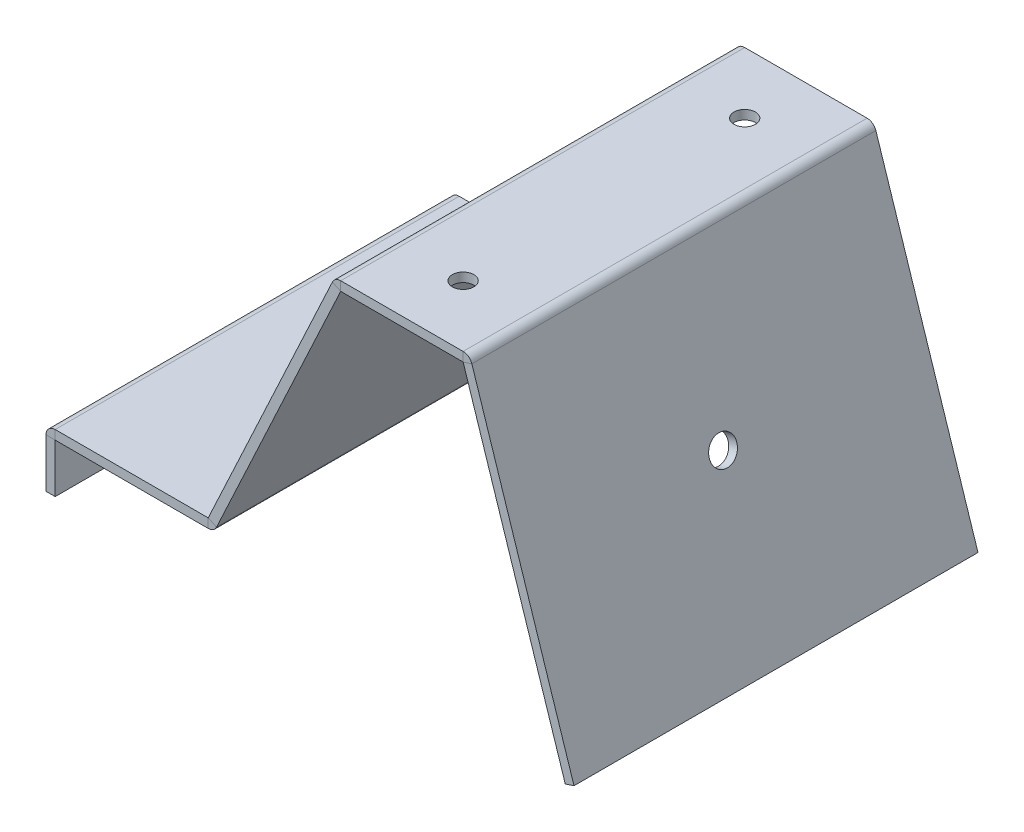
ISO-10303-21;
HEADER;
FILE_DESCRIPTION(('STEP AP214'),'2;1');
FILE_NAME('part.step','',(''),(''),'','','');
FILE_SCHEMA(('AUTOMOTIVE_DESIGN { 1 0 10303 214 1 1 1 1 }'));
ENDSEC;
DATA;
#1=APPLICATION_CONTEXT('core data for automotive mechanical design processes');
#2=APPLICATION_PROTOCOL_DEFINITION('international standard','automotive_design',2000,#1);
#3=PRODUCT_CONTEXT('',#1,'mechanical');
#4=PRODUCT('Part','Part','',(#3));
#5=PRODUCT_RELATED_PRODUCT_CATEGORY('part','',(#4));
#6=PRODUCT_DEFINITION_FORMATION('','',#4);
#7=PRODUCT_DEFINITION_CONTEXT('part definition',#1,'design');
#8=PRODUCT_DEFINITION('design','',#6,#7);
#9=PRODUCT_DEFINITION_SHAPE('','',#8);
#10=(LENGTH_UNIT() NAMED_UNIT(*) SI_UNIT(.MILLI.,.METRE.));
#11=(NAMED_UNIT(*) PLANE_ANGLE_UNIT() SI_UNIT($,.RADIAN.));
#12=(NAMED_UNIT(*) SI_UNIT($,.STERADIAN.) SOLID_ANGLE_UNIT());
#13=UNCERTAINTY_MEASURE_WITH_UNIT(LENGTH_MEASURE(1.E-05),#10,'distance_accuracy_value','');
#14=(GEOMETRIC_REPRESENTATION_CONTEXT(3) GLOBAL_UNCERTAINTY_ASSIGNED_CONTEXT((#13)) GLOBAL_UNIT_ASSIGNED_CONTEXT((#10,
#11,#12)) REPRESENTATION_CONTEXT('',''));
#15=CARTESIAN_POINT('',(0.,0.,0.));
#16=DIRECTION('',(0.,0.,1.));
#17=DIRECTION('',(1.,0.,0.));
#18=AXIS2_PLACEMENT_3D('',#15,#16,#17);
#19=CARTESIAN_POINT('',(-26.3546872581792,44.3689575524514,-66.));
#20=DIRECTION('',(0.,-1.,0.));
#21=DIRECTION('',(0.,0.,-1.));
#22=AXIS2_PLACEMENT_3D('',#19,#20,#21);
#23=PLANE('',#22);
#24=CARTESIAN_POINT('',(64.6453127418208,44.3689575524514,-10.));
#25=DIRECTION('',(0.,1.,0.));
#26=DIRECTION('',(0.,0.,1.));
#27=AXIS2_PLACEMENT_3D('',#24,#25,#26);
#28=CIRCLE('',#27,1.75);
#29=CARTESIAN_POINT('',(64.6453127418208,44.3689575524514,-8.25));
#30=VERTEX_POINT('',#29);
#31=EDGE_CURVE('E239',#30,#30,#28,.T.);
#32=ORIENTED_EDGE('',*,*,#31,.T.);
#33=EDGE_LOOP('',(#32));
#34=FACE_BOUND('',#33,.T.);
#35=CARTESIAN_POINT('',(64.6453127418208,44.3689575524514,-56.));
#36=DIRECTION('',(0.,1.,0.));
#37=DIRECTION('',(0.,0.,1.));
#38=AXIS2_PLACEMENT_3D('',#35,#36,#37);
#39=CIRCLE('',#38,1.75);
#40=CARTESIAN_POINT('',(64.6453127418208,44.3689575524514,-54.25));
#41=VERTEX_POINT('',#40);
#42=EDGE_CURVE('E236',#41,#41,#39,.T.);
#43=ORIENTED_EDGE('',*,*,#42,.T.);
#44=EDGE_LOOP('',(#43));
#45=FACE_BOUND('',#44,.T.);
#46=DIRECTION('',(-1.,0.,0.));
#47=VECTOR('',#46,1.);
#48=CARTESIAN_POINT('',(-26.3546872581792,44.3689575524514,-66.));
#49=LINE('',#48,#47);
#50=CARTESIAN_POINT('',(74.6446749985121,44.3689575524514,-66.));
#51=VERTEX_POINT('',#50);
#52=CARTESIAN_POINT('',(54.6458884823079,44.3689575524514,-66.));
#53=VERTEX_POINT('',#52);
#54=EDGE_CURVE('E65',#51,#53,#49,.T.);
#55=ORIENTED_EDGE('',*,*,#54,.F.);
#56=DIRECTION('',(0.,0.,1.));
#57=VECTOR('',#56,1.);
#58=CARTESIAN_POINT('',(74.6446749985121,44.3689575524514,-66.));
#59=LINE('',#58,#57);
#60=CARTESIAN_POINT('',(74.6446749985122,44.3689575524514,0.));
#61=VERTEX_POINT('',#60);
#62=EDGE_CURVE('E57',#51,#61,#59,.T.);
#63=ORIENTED_EDGE('',*,*,#62,.T.);
#64=DIRECTION('',(1.,0.,0.));
#65=VECTOR('',#64,1.);
#66=CARTESIAN_POINT('',(-26.3546872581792,44.3689575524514,0.));
#67=LINE('',#66,#65);
#68=CARTESIAN_POINT('',(54.6458884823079,44.3689575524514,0.));
#69=VERTEX_POINT('',#68);
#70=EDGE_CURVE('E73',#69,#61,#67,.T.);
#71=ORIENTED_EDGE('',*,*,#70,.F.);
#72=DIRECTION('',(0.,0.,1.));
#73=VECTOR('',#72,1.);
#74=CARTESIAN_POINT('',(54.6458884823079,44.3689575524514,-66.));
#75=LINE('',#74,#73);
#76=EDGE_CURVE('E226',#53,#69,#75,.T.);
#77=ORIENTED_EDGE('',*,*,#76,.F.);
#78=EDGE_LOOP('',(#55,#63,#71,#77));
#79=FACE_BOUND('',#78,.T.);
#80=ADVANCED_FACE('F48',(#34,#45,#79),#23,.T.);
#81=CARTESIAN_POINT('',(20.4131462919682,-29.042028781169,-66.));
#82=DIRECTION('',(0.906307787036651,-0.422618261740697,0.));
#83=DIRECTION('',(0.,0.,-1.));
#84=AXIS2_PLACEMENT_3D('',#81,#82,#83);
#85=PLANE('',#84);
#86=DIRECTION('',(-0.422618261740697,-0.906307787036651,0.));
#87=VECTOR('',#86,1.);
#88=CARTESIAN_POINT('',(20.4131462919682,-29.042028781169,-66.));
#89=LINE('',#88,#87);
#90=CARTESIAN_POINT('',(54.6449821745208,44.3683801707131,-66.));
#91=VERTEX_POINT('',#90);
#92=CARTESIAN_POINT('',(34.359792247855,0.866649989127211,-66.));
#93=VERTEX_POINT('',#92);
#94=EDGE_CURVE('E271',#91,#93,#89,.T.);
#95=ORIENTED_EDGE('',*,*,#94,.F.);
#96=DIRECTION('',(0.,0.,1.));
#97=VECTOR('',#96,1.);
#98=CARTESIAN_POINT('',(54.6449821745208,44.3683801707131,-66.));
#99=LINE('',#98,#97);
#100=CARTESIAN_POINT('',(54.6449821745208,44.3683801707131,0.));
#101=VERTEX_POINT('',#100);
#102=EDGE_CURVE('E377',#91,#101,#99,.T.);
#103=ORIENTED_EDGE('',*,*,#102,.T.);
#104=DIRECTION('',(0.422618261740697,0.906307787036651,0.));
#105=VECTOR('',#104,1.);
#106=CARTESIAN_POINT('',(20.4131462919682,-29.042028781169,0.));
#107=LINE('',#106,#105);
#108=CARTESIAN_POINT('',(34.359792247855,0.866649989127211,0.));
#109=VERTEX_POINT('',#108);
#110=EDGE_CURVE('E272',#109,#101,#107,.T.);
#111=ORIENTED_EDGE('',*,*,#110,.F.);
#112=DIRECTION('',(0.,0.,-1.));
#113=VECTOR('',#112,1.);
#114=CARTESIAN_POINT('',(34.359792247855,0.866649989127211,-66.));
#115=LINE('',#114,#113);
#116=EDGE_CURVE('E268',#109,#93,#115,.T.);
#117=ORIENTED_EDGE('',*,*,#116,.T.);
#118=EDGE_LOOP('',(#95,#103,#111,#117));
#119=FACE_BOUND('',#118,.T.);
#120=ADVANCED_FACE('F471',(#119),#85,.T.);
#121=CARTESIAN_POINT('',(0.,1.5,-66.));
#122=DIRECTION('',(0.,0.,1.));
#123=DIRECTION('',(1.,0.,0.));
#124=AXIS2_PLACEMENT_3D('',#121,#122,#123);
#125=PLANE('',#124);
#126=DIRECTION('',(-1.,0.,0.));
#127=VECTOR('',#126,1.);
#128=CARTESIAN_POINT('',(0.,1.5,-66.));
#129=LINE('',#128,#127);
#130=CARTESIAN_POINT('',(32.999424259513,1.5,-66.));
#131=VERTEX_POINT('',#130);
#132=CARTESIAN_POINT('',(8.00079717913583,1.5,-66.));
#133=VERTEX_POINT('',#132);
#134=EDGE_CURVE('E320',#131,#133,#129,.T.);
#135=ORIENTED_EDGE('',*,*,#134,.F.);
#136=DIRECTION('',(0.,-1.,0.));
#137=VECTOR('',#136,1.);
#138=CARTESIAN_POINT('',(32.999424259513,1.5,-66.));
#139=LINE('',#138,#137);
#140=CARTESIAN_POINT('',(32.999424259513,0.,-66.));
#141=VERTEX_POINT('',#140);
#142=EDGE_CURVE('E362',#131,#141,#139,.T.);
#143=ORIENTED_EDGE('',*,*,#142,.T.);
#144=DIRECTION('',(-1.,0.,0.));
#145=VECTOR('',#144,1.);
#146=CARTESIAN_POINT('',(0.,0.,-66.));
#147=LINE('',#146,#145);
#148=CARTESIAN_POINT('',(8.00079717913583,0.,-66.));
#149=VERTEX_POINT('',#148);
#150=EDGE_CURVE('E311',#141,#149,#147,.T.);
#151=ORIENTED_EDGE('',*,*,#150,.T.);
#152=DIRECTION('',(0.,1.,0.));
#153=VECTOR('',#152,1.);
#154=CARTESIAN_POINT('',(8.00079717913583,1.5,-66.));
#155=LINE('',#154,#153);
#156=EDGE_CURVE('E307',#149,#133,#155,.T.);
#157=ORIENTED_EDGE('',*,*,#156,.T.);
#158=EDGE_LOOP('',(#135,#143,#151,#157));
#159=FACE_BOUND('',#158,.T.);
#160=ADVANCED_FACE('F484',(#159),#125,.F.);
#161=CARTESIAN_POINT('',(0.,1.5,0.));
#162=DIRECTION('',(0.,0.,-1.));
#163=DIRECTION('',(-1.,0.,0.));
#164=AXIS2_PLACEMENT_3D('',#161,#162,#163);
#165=PLANE('',#164);
#166=DIRECTION('',(1.,0.,0.));
#167=VECTOR('',#166,1.);
#168=CARTESIAN_POINT('',(0.,0.,0.));
#169=LINE('',#168,#167);
#170=CARTESIAN_POINT('',(8.00079717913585,0.,0.));
#171=VERTEX_POINT('',#170);
#172=CARTESIAN_POINT('',(32.999424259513,0.,0.));
#173=VERTEX_POINT('',#172);
#174=EDGE_CURVE('E315',#171,#173,#169,.T.);
#175=ORIENTED_EDGE('',*,*,#174,.T.);
#176=DIRECTION('',(0.,1.,0.));
#177=VECTOR('',#176,1.);
#178=CARTESIAN_POINT('',(32.999424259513,1.5,0.));
#179=LINE('',#178,#177);
#180=CARTESIAN_POINT('',(32.999424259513,1.5,0.));
#181=VERTEX_POINT('',#180);
#182=EDGE_CURVE('E357',#173,#181,#179,.T.);
#183=ORIENTED_EDGE('',*,*,#182,.T.);
#184=DIRECTION('',(1.,0.,0.));
#185=VECTOR('',#184,1.);
#186=CARTESIAN_POINT('',(0.,1.5,0.));
#187=LINE('',#186,#185);
#188=CARTESIAN_POINT('',(8.00079717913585,1.5,0.));
#189=VERTEX_POINT('',#188);
#190=EDGE_CURVE('E316',#189,#181,#187,.T.);
#191=ORIENTED_EDGE('',*,*,#190,.F.);
#192=DIRECTION('',(0.,-1.,0.));
#193=VECTOR('',#192,1.);
#194=CARTESIAN_POINT('',(8.00079717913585,1.5,0.));
#195=LINE('',#194,#193);
#196=EDGE_CURVE('E312',#189,#171,#195,.T.);
#197=ORIENTED_EDGE('',*,*,#196,.T.);
#198=EDGE_LOOP('',(#175,#183,#191,#197));
#199=FACE_BOUND('',#198,.T.);
#200=ADVANCED_FACE('F503',(#199),#165,.F.);
#201=CARTESIAN_POINT('',(0.,1.5,-66.));
#202=DIRECTION('',(0.,-1.,0.));
#203=DIRECTION('',(0.,0.,-1.));
#204=AXIS2_PLACEMENT_3D('',#201,#202,#203);
#205=PLANE('',#204);
#206=ORIENTED_EDGE('',*,*,#190,.T.);
#207=DIRECTION('',(0.,0.,-1.));
#208=VECTOR('',#207,1.);
#209=CARTESIAN_POINT('',(32.999424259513,1.5,-66.));
#210=LINE('',#209,#208);
#211=EDGE_CURVE('E349',#181,#131,#210,.T.);
#212=ORIENTED_EDGE('',*,*,#211,.T.);
#213=ORIENTED_EDGE('',*,*,#134,.T.);
#214=DIRECTION('',(0.,0.,1.));
#215=VECTOR('',#214,1.);
#216=CARTESIAN_POINT('',(8.00079717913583,1.5,-66.));
#217=LINE('',#216,#215);
#218=EDGE_CURVE('E317',#133,#189,#217,.T.);
#219=ORIENTED_EDGE('',*,*,#218,.T.);
#220=EDGE_LOOP('',(#206,#212,#213,#219));
#221=FACE_BOUND('',#220,.T.);
#222=ADVANCED_FACE('F488',(#221),#205,.F.);
#223=CARTESIAN_POINT('',(7.99979717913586,-8.00020282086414,-66.));
#224=DIRECTION('',(1.,0.,0.));
#225=DIRECTION('',(0.,0.,-1.));
#226=AXIS2_PLACEMENT_3D('',#223,#224,#225);
#227=PLANE('',#226);
#228=DIRECTION('',(0.,-1.,0.));
#229=VECTOR('',#228,1.);
#230=CARTESIAN_POINT('',(7.99979717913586,-8.00020282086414,-66.));
#231=LINE('',#230,#229);
#232=CARTESIAN_POINT('',(7.99979717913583,-0.000999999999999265,-66.));
#233=VERTEX_POINT('',#232);
#234=CARTESIAN_POINT('',(7.99979717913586,-8.00020282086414,-66.));
#235=VERTEX_POINT('',#234);
#236=EDGE_CURVE('E326',#233,#235,#231,.T.);
#237=ORIENTED_EDGE('',*,*,#236,.F.);
#238=DIRECTION('',(0.,0.,1.));
#239=VECTOR('',#238,1.);
#240=CARTESIAN_POINT('',(7.99979717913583,-0.000999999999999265,-66.));
#241=LINE('',#240,#239);
#242=CARTESIAN_POINT('',(7.99979717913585,-0.000999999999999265,0.));
#243=VERTEX_POINT('',#242);
#244=EDGE_CURVE('E343',#233,#243,#241,.T.);
#245=ORIENTED_EDGE('',*,*,#244,.T.);
#246=DIRECTION('',(0.,1.,0.));
#247=VECTOR('',#246,1.);
#248=CARTESIAN_POINT('',(7.99979717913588,-8.00020282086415,0.));
#249=LINE('',#248,#247);
#250=CARTESIAN_POINT('',(7.99979717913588,-8.00020282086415,0.));
#251=VERTEX_POINT('',#250);
#252=EDGE_CURVE('E329',#251,#243,#249,.T.);
#253=ORIENTED_EDGE('',*,*,#252,.F.);
#254=DIRECTION('',(0.,0.,1.));
#255=VECTOR('',#254,1.);
#256=CARTESIAN_POINT('',(7.99979717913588,-8.00020282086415,0.));
#257=LINE('',#256,#255);
#258=EDGE_CURVE('E310',#235,#251,#257,.T.);
#259=ORIENTED_EDGE('',*,*,#258,.F.);
#260=EDGE_LOOP('',(#237,#245,#253,#259));
#261=FACE_BOUND('',#260,.T.);
#262=ADVANCED_FACE('F517',(#261),#227,.T.);
#263=CARTESIAN_POINT('',(6.49979717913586,-8.00020282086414,-66.));
#264=DIRECTION('',(1.,0.,0.));
#265=DIRECTION('',(0.,0.,-1.));
#266=AXIS2_PLACEMENT_3D('',#263,#264,#265);
#267=PLANE('',#266);
#268=DIRECTION('',(0.,0.,1.));
#269=VECTOR('',#268,1.);
#270=CARTESIAN_POINT('',(6.49979717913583,-0.00100000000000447,-66.));
#271=LINE('',#270,#269);
#272=CARTESIAN_POINT('',(6.49979717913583,-0.00100000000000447,-66.));
#273=VERTEX_POINT('',#272);
#274=CARTESIAN_POINT('',(6.49979717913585,-0.00100000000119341,0.));
#275=VERTEX_POINT('',#274);
#276=EDGE_CURVE('E337',#273,#275,#271,.T.);
#277=ORIENTED_EDGE('',*,*,#276,.F.);
#278=DIRECTION('',(0.,-1.,0.));
#279=VECTOR('',#278,1.);
#280=CARTESIAN_POINT('',(6.49979717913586,-8.00020282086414,-66.));
#281=LINE('',#280,#279);
#282=CARTESIAN_POINT('',(6.49979717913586,-8.00020282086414,-66.));
#283=VERTEX_POINT('',#282);
#284=EDGE_CURVE('E334',#273,#283,#281,.T.);
#285=ORIENTED_EDGE('',*,*,#284,.T.);
#286=DIRECTION('',(0.,0.,1.));
#287=VECTOR('',#286,1.);
#288=CARTESIAN_POINT('',(6.49979717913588,-8.00020282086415,0.));
#289=LINE('',#288,#287);
#290=CARTESIAN_POINT('',(6.49979717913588,-8.00020282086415,0.));
#291=VERTEX_POINT('',#290);
#292=EDGE_CURVE('E322',#283,#291,#289,.T.);
#293=ORIENTED_EDGE('',*,*,#292,.T.);
#294=DIRECTION('',(0.,1.,0.));
#295=VECTOR('',#294,1.);
#296=CARTESIAN_POINT('',(6.49979717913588,-8.00020282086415,0.));
#297=LINE('',#296,#295);
#298=EDGE_CURVE('E325',#291,#275,#297,.T.);
#299=ORIENTED_EDGE('',*,*,#298,.T.);
#300=EDGE_LOOP('',(#277,#285,#293,#299));
#301=FACE_BOUND('',#300,.T.);
#302=ADVANCED_FACE('F525',(#301),#267,.F.);
#303=CARTESIAN_POINT('',(6.49979717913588,-8.00020282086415,0.));
#304=DIRECTION('',(0.,1.,0.));
#305=DIRECTION('',(0.,0.,-1.));
#306=AXIS2_PLACEMENT_3D('',#303,#304,#305);
#307=PLANE('',#306);
#308=ORIENTED_EDGE('',*,*,#258,.T.);
#309=DIRECTION('',(1.,0.,0.));
#310=VECTOR('',#309,1.);
#311=CARTESIAN_POINT('',(6.49979717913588,-8.00020282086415,0.));
#312=LINE('',#311,#310);
#313=EDGE_CURVE('E333',#291,#251,#312,.T.);
#314=ORIENTED_EDGE('',*,*,#313,.F.);
#315=ORIENTED_EDGE('',*,*,#292,.F.);
#316=DIRECTION('',(1.,0.,0.));
#317=VECTOR('',#316,1.);
#318=CARTESIAN_POINT('',(6.49979717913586,-8.00020282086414,-66.));
#319=LINE('',#318,#317);
#320=EDGE_CURVE('E330',#283,#235,#319,.T.);
#321=ORIENTED_EDGE('',*,*,#320,.T.);
#322=EDGE_LOOP('',(#308,#314,#315,#321));
#323=FACE_BOUND('',#322,.T.);
#324=ADVANCED_FACE('F530',(#323),#307,.F.);
#325=CARTESIAN_POINT('',(6.49979717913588,-8.00020282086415,0.));
#326=DIRECTION('',(0.,0.,-1.));
#327=DIRECTION('',(0.,-1.,0.));
#328=AXIS2_PLACEMENT_3D('',#325,#326,#327);
#329=PLANE('',#328);
#330=DIRECTION('',(1.,0.,0.));
#331=VECTOR('',#330,1.);
#332=CARTESIAN_POINT('',(6.49979717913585,-0.00100000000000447,0.));
#333=LINE('',#332,#331);
#334=EDGE_CURVE('E340',#275,#243,#333,.T.);
#335=ORIENTED_EDGE('',*,*,#334,.F.);
#336=ORIENTED_EDGE('',*,*,#298,.F.);
#337=ORIENTED_EDGE('',*,*,#313,.T.);
#338=ORIENTED_EDGE('',*,*,#252,.T.);
#339=EDGE_LOOP('',(#335,#336,#337,#338));
#340=FACE_BOUND('',#339,.T.);
#341=ADVANCED_FACE('F528',(#340),#329,.F.);
#342=CARTESIAN_POINT('',(6.49979717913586,-8.00020282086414,-66.));
#343=DIRECTION('',(0.,0.,1.));
#344=DIRECTION('',(0.,1.,0.));
#345=AXIS2_PLACEMENT_3D('',#342,#343,#344);
#346=PLANE('',#345);
#347=DIRECTION('',(-1.,0.,0.));
#348=VECTOR('',#347,1.);
#349=CARTESIAN_POINT('',(6.49979717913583,-0.00100000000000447,-66.));
#350=LINE('',#349,#348);
#351=EDGE_CURVE('E346',#233,#273,#350,.T.);
#352=ORIENTED_EDGE('',*,*,#351,.F.);
#353=ORIENTED_EDGE('',*,*,#236,.T.);
#354=ORIENTED_EDGE('',*,*,#320,.F.);
#355=ORIENTED_EDGE('',*,*,#284,.F.);
#356=EDGE_LOOP('',(#352,#353,#354,#355));
#357=FACE_BOUND('',#356,.T.);
#358=ADVANCED_FACE('F522',(#357),#346,.F.);
#359=CARTESIAN_POINT('',(0.,0.,-66.));
#360=DIRECTION('',(0.,-1.,0.));
#361=DIRECTION('',(0.,0.,-1.));
#362=AXIS2_PLACEMENT_3D('',#359,#360,#361);
#363=PLANE('',#362);
#364=DIRECTION('',(0.,0.,-1.));
#365=VECTOR('',#364,1.);
#366=CARTESIAN_POINT('',(32.999424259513,0.,-66.));
#367=LINE('',#366,#365);
#368=EDGE_CURVE('E360',#173,#141,#367,.T.);
#369=ORIENTED_EDGE('',*,*,#368,.F.);
#370=ORIENTED_EDGE('',*,*,#174,.F.);
#371=DIRECTION('',(0.,0.,1.));
#372=VECTOR('',#371,1.);
#373=CARTESIAN_POINT('',(8.00079717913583,0.,-66.));
#374=LINE('',#373,#372);
#375=EDGE_CURVE('E302',#149,#171,#374,.T.);
#376=ORIENTED_EDGE('',*,*,#375,.F.);
#377=ORIENTED_EDGE('',*,*,#150,.F.);
#378=EDGE_LOOP('',(#369,#370,#376,#377));
#379=FACE_BOUND('',#378,.T.);
#380=ADVANCED_FACE('F511',(#379),#363,.T.);
#381=CARTESIAN_POINT('',(8.00079717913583,-0.000999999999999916,-66.));
#382=DIRECTION('',(0.,0.,-1.));
#383=DIRECTION('',(-1.,0.,0.));
#384=AXIS2_PLACEMENT_3D('',#381,#382,#383);
#385=PLANE('',#384);
#386=ORIENTED_EDGE('',*,*,#156,.F.);
#387=CARTESIAN_POINT('',(8.00079717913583,-0.000999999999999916,-66.));
#388=DIRECTION('',(0.,0.,1.));
#389=DIRECTION('',(1.,0.,0.));
#390=AXIS2_PLACEMENT_3D('',#387,#388,#389);
#391=CIRCLE('',#390,0.000999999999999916);
#392=EDGE_CURVE('E289',#149,#233,#391,.T.);
#393=ORIENTED_EDGE('',*,*,#392,.T.);
#394=ORIENTED_EDGE('',*,*,#351,.T.);
#395=CARTESIAN_POINT('',(8.00079717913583,-0.000999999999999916,-66.));
#396=DIRECTION('',(0.,0.,1.));
#397=DIRECTION('',(1.,0.,0.));
#398=AXIS2_PLACEMENT_3D('',#395,#396,#397);
#399=CIRCLE('',#398,1.501);
#400=EDGE_CURVE('E295',#133,#273,#399,.T.);
#401=ORIENTED_EDGE('',*,*,#400,.F.);
#402=EDGE_LOOP('',(#386,#393,#394,#401));
#403=FACE_BOUND('',#402,.T.);
#404=ADVANCED_FACE('F492',(#403),#385,.T.);
#405=CARTESIAN_POINT('',(8.00079717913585,-0.000999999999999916,0.));
#406=DIRECTION('',(0.,0.,1.));
#407=DIRECTION('',(1.,0.,0.));
#408=AXIS2_PLACEMENT_3D('',#405,#406,#407);
#409=PLANE('',#408);
#410=ORIENTED_EDGE('',*,*,#334,.T.);
#411=CARTESIAN_POINT('',(8.00079717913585,-0.000999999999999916,0.));
#412=DIRECTION('',(0.,0.,1.));
#413=DIRECTION('',(1.,0.,0.));
#414=AXIS2_PLACEMENT_3D('',#411,#412,#413);
#415=CIRCLE('',#414,0.000999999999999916);
#416=EDGE_CURVE('E299',#243,#171,#415,.F.);
#417=ORIENTED_EDGE('',*,*,#416,.T.);
#418=ORIENTED_EDGE('',*,*,#196,.F.);
#419=CARTESIAN_POINT('',(8.00079717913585,-0.000999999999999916,0.));
#420=DIRECTION('',(0.,0.,-1.));
#421=DIRECTION('',(-1.,0.,0.));
#422=AXIS2_PLACEMENT_3D('',#419,#420,#421);
#423=CIRCLE('',#422,1.501);
#424=EDGE_CURVE('E298',#275,#189,#423,.T.);
#425=ORIENTED_EDGE('',*,*,#424,.F.);
#426=EDGE_LOOP('',(#410,#417,#418,#425));
#427=FACE_BOUND('',#426,.T.);
#428=ADVANCED_FACE('F499',(#427),#409,.T.);
#429=CARTESIAN_POINT('',(8.00079717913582,-0.000999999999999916,-99.0170432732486));
#430=DIRECTION('',(0.,0.,1.));
#431=DIRECTION('',(1.,0.,0.));
#432=AXIS2_PLACEMENT_3D('',#429,#430,#431);
#433=CYLINDRICAL_SURFACE('',#432,1.501);
#434=ORIENTED_EDGE('',*,*,#424,.T.);
#435=ORIENTED_EDGE('',*,*,#218,.F.);
#436=ORIENTED_EDGE('',*,*,#400,.T.);
#437=ORIENTED_EDGE('',*,*,#276,.T.);
#438=EDGE_LOOP('',(#434,#435,#436,#437));
#439=FACE_BOUND('',#438,.T.);
#440=ADVANCED_FACE('F496',(#439),#433,.T.);
#441=CARTESIAN_POINT('',(8.00079717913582,-0.000999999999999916,-99.0170432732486));
#442=DIRECTION('',(0.,0.,1.));
#443=DIRECTION('',(1.,0.,0.));
#444=AXIS2_PLACEMENT_3D('',#441,#442,#443);
#445=CYLINDRICAL_SURFACE('',#444,0.000999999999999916);
#446=ORIENTED_EDGE('',*,*,#416,.F.);
#447=ORIENTED_EDGE('',*,*,#244,.F.);
#448=ORIENTED_EDGE('',*,*,#392,.F.);
#449=ORIENTED_EDGE('',*,*,#375,.T.);
#450=EDGE_LOOP('',(#446,#447,#448,#449));
#451=FACE_BOUND('',#450,.T.);
#452=ADVANCED_FACE('F514',(#451),#445,.F.);
#453=CARTESIAN_POINT('',(32.999424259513,1.501,0.));
#454=DIRECTION('',(0.,0.,-1.));
#455=DIRECTION('',(-1.,0.,0.));
#456=AXIS2_PLACEMENT_3D('',#453,#454,#455);
#457=PLANE('',#456);
#458=ORIENTED_EDGE('',*,*,#182,.F.);
#459=CARTESIAN_POINT('',(32.999424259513,1.501,0.));
#460=DIRECTION('',(0.,0.,-1.));
#461=DIRECTION('',(-1.,0.,0.));
#462=AXIS2_PLACEMENT_3D('',#459,#460,#461);
#463=CIRCLE('',#462,1.501);
#464=EDGE_CURVE('E292',#173,#109,#463,.F.);
#465=ORIENTED_EDGE('',*,*,#464,.T.);
#466=DIRECTION('',(-0.906307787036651,0.422618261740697,0.));
#467=VECTOR('',#466,1.);
#468=CARTESIAN_POINT('',(33.0003305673,1.50057738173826,0.));
#469=LINE('',#468,#467);
#470=CARTESIAN_POINT('',(33.0003305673,1.50057738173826,0.));
#471=VERTEX_POINT('',#470);
#472=EDGE_CURVE('E273',#109,#471,#469,.T.);
#473=ORIENTED_EDGE('',*,*,#472,.T.);
#474=CARTESIAN_POINT('',(32.999424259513,1.501,0.));
#475=DIRECTION('',(0.,0.,1.));
#476=DIRECTION('',(1.,0.,0.));
#477=AXIS2_PLACEMENT_3D('',#474,#475,#476);
#478=CIRCLE('',#477,0.000999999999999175);
#479=EDGE_CURVE('E282',#181,#471,#478,.T.);
#480=ORIENTED_EDGE('',*,*,#479,.F.);
#481=EDGE_LOOP('',(#458,#465,#473,#480));
#482=FACE_BOUND('',#481,.T.);
#483=ADVANCED_FACE('F507',(#482),#457,.F.);
#484=CARTESIAN_POINT('',(32.999424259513,1.501,-66.));
#485=DIRECTION('',(0.,0.,1.));
#486=DIRECTION('',(1.,0.,0.));
#487=AXIS2_PLACEMENT_3D('',#484,#485,#486);
#488=PLANE('',#487);
#489=DIRECTION('',(0.906307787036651,-0.422618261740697,0.));
#490=VECTOR('',#489,1.);
#491=CARTESIAN_POINT('',(33.0003305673,1.50057738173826,-66.));
#492=LINE('',#491,#490);
#493=CARTESIAN_POINT('',(33.0003305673,1.50057738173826,-66.));
#494=VERTEX_POINT('',#493);
#495=EDGE_CURVE('E277',#494,#93,#492,.T.);
#496=ORIENTED_EDGE('',*,*,#495,.T.);
#497=CARTESIAN_POINT('',(32.999424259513,1.501,-66.));
#498=DIRECTION('',(0.,0.,-1.));
#499=DIRECTION('',(-1.,0.,0.));
#500=AXIS2_PLACEMENT_3D('',#497,#498,#499);
#501=CIRCLE('',#500,1.501);
#502=EDGE_CURVE('E286',#93,#141,#501,.T.);
#503=ORIENTED_EDGE('',*,*,#502,.T.);
#504=ORIENTED_EDGE('',*,*,#142,.F.);
#505=CARTESIAN_POINT('',(32.999424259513,1.501,-66.));
#506=DIRECTION('',(0.,0.,-1.));
#507=DIRECTION('',(-1.,0.,0.));
#508=AXIS2_PLACEMENT_3D('',#505,#506,#507);
#509=CIRCLE('',#508,0.000999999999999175);
#510=EDGE_CURVE('E285',#494,#131,#509,.T.);
#511=ORIENTED_EDGE('',*,*,#510,.F.);
#512=EDGE_LOOP('',(#496,#503,#504,#511));
#513=FACE_BOUND('',#512,.T.);
#514=ADVANCED_FACE('F480',(#513),#488,.F.);
#515=CARTESIAN_POINT('',(32.999424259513,1.501,33.0170432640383));
#516=DIRECTION('',(0.,0.,-1.));
#517=DIRECTION('',(-1.,0.,0.));
#518=AXIS2_PLACEMENT_3D('',#515,#516,#517);
#519=CYLINDRICAL_SURFACE('',#518,0.001);
#520=ORIENTED_EDGE('',*,*,#510,.T.);
#521=ORIENTED_EDGE('',*,*,#211,.F.);
#522=ORIENTED_EDGE('',*,*,#479,.T.);
#523=DIRECTION('',(0.,0.,-1.));
#524=VECTOR('',#523,1.);
#525=CARTESIAN_POINT('',(33.0003305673,1.50057738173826,-66.));
#526=LINE('',#525,#524);
#527=EDGE_CURVE('E263',#471,#494,#526,.T.);
#528=ORIENTED_EDGE('',*,*,#527,.T.);
#529=EDGE_LOOP('',(#520,#521,#522,#528));
#530=FACE_BOUND('',#529,.T.);
#531=ADVANCED_FACE('F478',(#530),#519,.F.);
#532=CARTESIAN_POINT('',(32.999424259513,1.501,33.0170432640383));
#533=DIRECTION('',(0.,0.,-1.));
#534=DIRECTION('',(-1.,0.,0.));
#535=AXIS2_PLACEMENT_3D('',#532,#533,#534);
#536=CYLINDRICAL_SURFACE('',#535,1.501);
#537=ORIENTED_EDGE('',*,*,#502,.F.);
#538=ORIENTED_EDGE('',*,*,#116,.F.);
#539=ORIENTED_EDGE('',*,*,#464,.F.);
#540=ORIENTED_EDGE('',*,*,#368,.T.);
#541=EDGE_LOOP('',(#537,#538,#539,#540));
#542=FACE_BOUND('',#541,.T.);
#543=ADVANCED_FACE('F509',(#542),#536,.T.);
#544=CARTESIAN_POINT('',(19.0536846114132,-28.4081013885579,-66.));
#545=DIRECTION('',(0.906307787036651,-0.422618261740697,0.));
#546=DIRECTION('',(0.,0.,-1.));
#547=AXIS2_PLACEMENT_3D('',#544,#545,#546);
#548=PLANE('',#547);
#549=DIRECTION('',(0.,0.,1.));
#550=VECTOR('',#549,1.);
#551=CARTESIAN_POINT('',(53.2855204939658,45.0023075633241,-66.));
#552=LINE('',#551,#550);
#553=CARTESIAN_POINT('',(53.2855204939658,45.0023075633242,-66.));
#554=VERTEX_POINT('',#553);
#555=CARTESIAN_POINT('',(53.2855204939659,45.0023075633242,0.));
#556=VERTEX_POINT('',#555);
#557=EDGE_CURVE('E365',#554,#556,#552,.T.);
#558=ORIENTED_EDGE('',*,*,#557,.F.);
#559=DIRECTION('',(-0.422618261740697,-0.906307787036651,0.));
#560=VECTOR('',#559,1.);
#561=CARTESIAN_POINT('',(19.0536846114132,-28.4081013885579,-66.));
#562=LINE('',#561,#560);
#563=EDGE_CURVE('E386',#554,#494,#562,.T.);
#564=ORIENTED_EDGE('',*,*,#563,.T.);
#565=ORIENTED_EDGE('',*,*,#527,.F.);
#566=DIRECTION('',(0.422618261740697,0.906307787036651,0.));
#567=VECTOR('',#566,1.);
#568=CARTESIAN_POINT('',(19.0536846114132,-28.4081013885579,0.));
#569=LINE('',#568,#567);
#570=EDGE_CURVE('E276',#471,#556,#569,.T.);
#571=ORIENTED_EDGE('',*,*,#570,.T.);
#572=EDGE_LOOP('',(#558,#564,#565,#571));
#573=FACE_BOUND('',#572,.T.);
#574=ADVANCED_FACE('F463',(#573),#548,.F.);
#575=CARTESIAN_POINT('',(19.0536846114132,-28.4081013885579,0.));
#576=DIRECTION('',(0.,0.,-1.));
#577=DIRECTION('',(-0.422618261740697,-0.906307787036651,0.));
#578=AXIS2_PLACEMENT_3D('',#575,#576,#577);
#579=PLANE('',#578);
#580=DIRECTION('',(0.906307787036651,-0.422618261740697,0.));
#581=VECTOR('',#580,1.);
#582=CARTESIAN_POINT('',(53.2855204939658,45.0023075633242,0.));
#583=LINE('',#582,#581);
#584=EDGE_CURVE('E374',#556,#101,#583,.T.);
#585=ORIENTED_EDGE('',*,*,#584,.F.);
#586=ORIENTED_EDGE('',*,*,#570,.F.);
#587=ORIENTED_EDGE('',*,*,#472,.F.);
#588=ORIENTED_EDGE('',*,*,#110,.T.);
#589=EDGE_LOOP('',(#585,#586,#587,#588));
#590=FACE_BOUND('',#589,.T.);
#591=ADVANCED_FACE('F468',(#590),#579,.F.);
#592=CARTESIAN_POINT('',(19.0536846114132,-28.4081013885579,-66.));
#593=DIRECTION('',(0.,0.,1.));
#594=DIRECTION('',(0.422618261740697,0.906307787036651,0.));
#595=AXIS2_PLACEMENT_3D('',#592,#593,#594);
#596=PLANE('',#595);
#597=DIRECTION('',(-0.906307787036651,0.422618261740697,0.));
#598=VECTOR('',#597,1.);
#599=CARTESIAN_POINT('',(53.2855204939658,45.0023075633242,-66.));
#600=LINE('',#599,#598);
#601=EDGE_CURVE('E380',#91,#554,#600,.T.);
#602=ORIENTED_EDGE('',*,*,#601,.F.);
#603=ORIENTED_EDGE('',*,*,#94,.T.);
#604=ORIENTED_EDGE('',*,*,#495,.F.);
#605=ORIENTED_EDGE('',*,*,#563,.F.);
#606=EDGE_LOOP('',(#602,#603,#604,#605));
#607=FACE_BOUND('',#606,.T.);
#608=ADVANCED_FACE('F473',(#607),#596,.F.);
#609=CARTESIAN_POINT('',(54.6458884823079,44.3679575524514,-66.));
#610=DIRECTION('',(0.,0.,-1.));
#611=DIRECTION('',(-1.,0.,0.));
#612=AXIS2_PLACEMENT_3D('',#609,#610,#611);
#613=PLANE('',#612);
#614=DIRECTION('',(0.,1.,0.));
#615=VECTOR('',#614,1.);
#616=CARTESIAN_POINT('',(54.6458884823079,45.8689575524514,-66.));
#617=LINE('',#616,#615);
#618=CARTESIAN_POINT('',(54.6458884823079,45.8689575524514,-66.));
#619=VERTEX_POINT('',#618);
#620=EDGE_CURVE('E232',#53,#619,#617,.T.);
#621=ORIENTED_EDGE('',*,*,#620,.F.);
#622=CARTESIAN_POINT('',(54.6458884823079,44.3679575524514,-66.));
#623=DIRECTION('',(0.,0.,-1.));
#624=DIRECTION('',(-1.,0.,0.));
#625=AXIS2_PLACEMENT_3D('',#622,#623,#624);
#626=CIRCLE('',#625,0.000999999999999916);
#627=EDGE_CURVE('E235',#53,#91,#626,.F.);
#628=ORIENTED_EDGE('',*,*,#627,.T.);
#629=ORIENTED_EDGE('',*,*,#601,.T.);
#630=CARTESIAN_POINT('',(54.6458884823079,44.3679575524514,-66.));
#631=DIRECTION('',(0.,0.,1.));
#632=DIRECTION('',(1.,0.,0.));
#633=AXIS2_PLACEMENT_3D('',#630,#631,#632);
#634=CIRCLE('',#633,1.501);
#635=EDGE_CURVE('E256',#619,#554,#634,.T.);
#636=ORIENTED_EDGE('',*,*,#635,.F.);
#637=EDGE_LOOP('',(#621,#628,#629,#636));
#638=FACE_BOUND('',#637,.T.);
#639=ADVANCED_FACE('F456',(#638),#613,.T.);
#640=CARTESIAN_POINT('',(54.6458884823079,44.3679575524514,0.));
#641=DIRECTION('',(0.,0.,1.));
#642=DIRECTION('',(1.,0.,0.));
#643=AXIS2_PLACEMENT_3D('',#640,#641,#642);
#644=PLANE('',#643);
#645=ORIENTED_EDGE('',*,*,#584,.T.);
#646=CARTESIAN_POINT('',(54.6458884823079,44.3679575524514,0.));
#647=DIRECTION('',(0.,0.,-1.));
#648=DIRECTION('',(-1.,0.,0.));
#649=AXIS2_PLACEMENT_3D('',#646,#647,#648);
#650=CIRCLE('',#649,0.000999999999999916);
#651=EDGE_CURVE('E260',#101,#69,#650,.T.);
#652=ORIENTED_EDGE('',*,*,#651,.T.);
#653=DIRECTION('',(0.,-1.,0.));
#654=VECTOR('',#653,1.);
#655=CARTESIAN_POINT('',(54.6458884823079,45.8689575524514,0.));
#656=LINE('',#655,#654);
#657=CARTESIAN_POINT('',(54.6458884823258,45.8689575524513,0.));
#658=VERTEX_POINT('',#657);
#659=EDGE_CURVE('E242',#658,#69,#656,.T.);
#660=ORIENTED_EDGE('',*,*,#659,.F.);
#661=CARTESIAN_POINT('',(54.6458884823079,44.3679575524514,0.));
#662=DIRECTION('',(0.,0.,-1.));
#663=DIRECTION('',(-1.,0.,0.));
#664=AXIS2_PLACEMENT_3D('',#661,#662,#663);
#665=CIRCLE('',#664,1.501);
#666=EDGE_CURVE('E259',#556,#658,#665,.T.);
#667=ORIENTED_EDGE('',*,*,#666,.F.);
#668=EDGE_LOOP('',(#645,#652,#660,#667));
#669=FACE_BOUND('',#668,.T.);
#670=ADVANCED_FACE('F449',(#669),#644,.T.);
#671=CARTESIAN_POINT('',(54.6458884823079,44.3679575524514,33.0170633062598));
#672=DIRECTION('',(0.,0.,-1.));
#673=DIRECTION('',(-1.,0.,0.));
#674=AXIS2_PLACEMENT_3D('',#671,#672,#673);
#675=CYLINDRICAL_SURFACE('',#674,1.501);
#676=ORIENTED_EDGE('',*,*,#666,.T.);
#677=DIRECTION('',(0.,0.,1.));
#678=VECTOR('',#677,1.);
#679=CARTESIAN_POINT('',(54.6458884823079,45.8689575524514,-66.));
#680=LINE('',#679,#678);
#681=EDGE_CURVE('E245',#619,#658,#680,.T.);
#682=ORIENTED_EDGE('',*,*,#681,.F.);
#683=ORIENTED_EDGE('',*,*,#635,.T.);
#684=ORIENTED_EDGE('',*,*,#557,.T.);
#685=EDGE_LOOP('',(#676,#682,#683,#684));
#686=FACE_BOUND('',#685,.T.);
#687=ADVANCED_FACE('F460',(#686),#675,.T.);
#688=CARTESIAN_POINT('',(54.6458884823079,44.3679575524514,33.0170633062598));
#689=DIRECTION('',(0.,0.,-1.));
#690=DIRECTION('',(-1.,0.,0.));
#691=AXIS2_PLACEMENT_3D('',#688,#689,#690);
#692=CYLINDRICAL_SURFACE('',#691,0.000999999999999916);
#693=ORIENTED_EDGE('',*,*,#651,.F.);
#694=ORIENTED_EDGE('',*,*,#102,.F.);
#695=ORIENTED_EDGE('',*,*,#627,.F.);
#696=ORIENTED_EDGE('',*,*,#76,.T.);
#697=EDGE_LOOP('',(#693,#694,#695,#696));
#698=FACE_BOUND('',#697,.T.);
#699=ADVANCED_FACE('F454',(#698),#692,.F.);
#700=CARTESIAN_POINT('',(64.6453127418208,45.8689575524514,-56.));
#701=DIRECTION('',(0.,-1.,0.));
#702=DIRECTION('',(0.,0.,-1.));
#703=AXIS2_PLACEMENT_3D('',#700,#701,#702);
#704=CYLINDRICAL_SURFACE('',#703,1.75);
#705=CARTESIAN_POINT('',(64.6453127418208,45.8689575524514,-56.));
#706=DIRECTION('',(0.,1.,0.));
#707=DIRECTION('',(0.,0.,1.));
#708=AXIS2_PLACEMENT_3D('',#705,#706,#707);
#709=CIRCLE('',#708,1.75);
#710=CARTESIAN_POINT('',(64.6453127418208,45.8689575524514,-54.25));
#711=VERTEX_POINT('',#710);
#712=EDGE_CURVE('E251',#711,#711,#709,.T.);
#713=ORIENTED_EDGE('',*,*,#712,.T.);
#714=EDGE_LOOP('',(#713));
#715=FACE_BOUND('',#714,.T.);
#716=ORIENTED_EDGE('',*,*,#42,.F.);
#717=EDGE_LOOP('',(#716));
#718=FACE_BOUND('',#717,.T.);
#719=ADVANCED_FACE('F759',(#715,#718),#704,.F.);
#720=CARTESIAN_POINT('',(64.6453127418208,45.8689575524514,-10.));
#721=DIRECTION('',(0.,-1.,0.));
#722=DIRECTION('',(0.,0.,-1.));
#723=AXIS2_PLACEMENT_3D('',#720,#721,#722);
#724=CYLINDRICAL_SURFACE('',#723,1.75);
#725=CARTESIAN_POINT('',(64.6453127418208,45.8689575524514,-10.));
#726=DIRECTION('',(0.,1.,0.));
#727=DIRECTION('',(0.,0.,1.));
#728=AXIS2_PLACEMENT_3D('',#725,#726,#727);
#729=CIRCLE('',#728,1.75);
#730=CARTESIAN_POINT('',(64.6453127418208,45.8689575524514,-8.25));
#731=VERTEX_POINT('',#730);
#732=EDGE_CURVE('E248',#731,#731,#729,.T.);
#733=ORIENTED_EDGE('',*,*,#732,.T.);
#734=EDGE_LOOP('',(#733));
#735=FACE_BOUND('',#734,.T.);
#736=ORIENTED_EDGE('',*,*,#31,.F.);
#737=EDGE_LOOP('',(#736));
#738=FACE_BOUND('',#737,.T.);
#739=ADVANCED_FACE('F552',(#735,#738),#724,.F.);
#740=CARTESIAN_POINT('',(-26.3546872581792,45.8689575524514,-66.));
#741=DIRECTION('',(0.,-1.,0.));
#742=DIRECTION('',(0.,0.,-1.));
#743=AXIS2_PLACEMENT_3D('',#740,#741,#742);
#744=PLANE('',#743);
#745=DIRECTION('',(0.,0.,1.));
#746=VECTOR('',#745,1.);
#747=CARTESIAN_POINT('',(74.6446749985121,45.8689575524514,-66.));
#748=LINE('',#747,#746);
#749=CARTESIAN_POINT('',(74.6446749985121,45.8689575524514,-66.));
#750=VERTEX_POINT('',#749);
#751=CARTESIAN_POINT('',(74.6446749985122,45.8689575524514,0.));
#752=VERTEX_POINT('',#751);
#753=EDGE_CURVE('E383',#750,#752,#748,.T.);
#754=ORIENTED_EDGE('',*,*,#753,.F.);
#755=DIRECTION('',(-1.,0.,0.));
#756=VECTOR('',#755,1.);
#757=CARTESIAN_POINT('',(-26.3546872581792,45.8689575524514,-66.));
#758=LINE('',#757,#756);
#759=EDGE_CURVE('E52',#750,#619,#758,.T.);
#760=ORIENTED_EDGE('',*,*,#759,.T.);
#761=ORIENTED_EDGE('',*,*,#681,.T.);
#762=DIRECTION('',(1.,0.,0.));
#763=VECTOR('',#762,1.);
#764=CARTESIAN_POINT('',(-26.3546872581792,45.8689575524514,0.));
#765=LINE('',#764,#763);
#766=EDGE_CURVE('E244',#658,#752,#765,.T.);
#767=ORIENTED_EDGE('',*,*,#766,.T.);
#768=EDGE_LOOP('',(#754,#760,#761,#767));
#769=FACE_BOUND('',#768,.T.);
#770=ORIENTED_EDGE('',*,*,#732,.F.);
#771=EDGE_LOOP('',(#770));
#772=FACE_BOUND('',#771,.T.);
#773=ORIENTED_EDGE('',*,*,#712,.F.);
#774=EDGE_LOOP('',(#773));
#775=FACE_BOUND('',#774,.T.);
#776=ADVANCED_FACE('F398',(#769,#772,#775),#744,.F.);
#777=CARTESIAN_POINT('',(-26.3546872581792,45.8689575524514,0.));
#778=DIRECTION('',(0.,0.,-1.));
#779=DIRECTION('',(-1.,0.,0.));
#780=AXIS2_PLACEMENT_3D('',#777,#778,#779);
#781=PLANE('',#780);
#782=DIRECTION('',(0.,-1.,0.));
#783=VECTOR('',#782,1.);
#784=CARTESIAN_POINT('',(74.6446749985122,45.8689575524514,0.));
#785=LINE('',#784,#783);
#786=EDGE_CURVE('E391',#752,#61,#785,.T.);
#787=ORIENTED_EDGE('',*,*,#786,.F.);
#788=ORIENTED_EDGE('',*,*,#766,.F.);
#789=ORIENTED_EDGE('',*,*,#659,.T.);
#790=ORIENTED_EDGE('',*,*,#70,.T.);
#791=EDGE_LOOP('',(#787,#788,#789,#790));
#792=FACE_BOUND('',#791,.T.);
#793=ADVANCED_FACE('F402',(#792),#781,.F.);
#794=CARTESIAN_POINT('',(-26.3546872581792,45.8689575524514,-66.));
#795=DIRECTION('',(0.,0.,1.));
#796=DIRECTION('',(1.,0.,0.));
#797=AXIS2_PLACEMENT_3D('',#794,#795,#796);
#798=PLANE('',#797);
#799=DIRECTION('',(0.,1.,0.));
#800=VECTOR('',#799,1.);
#801=CARTESIAN_POINT('',(74.6446749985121,45.8689575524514,-66.));
#802=LINE('',#801,#800);
#803=EDGE_CURVE('E12',#51,#750,#802,.T.);
#804=ORIENTED_EDGE('',*,*,#803,.F.);
#805=ORIENTED_EDGE('',*,*,#54,.T.);
#806=ORIENTED_EDGE('',*,*,#620,.T.);
#807=ORIENTED_EDGE('',*,*,#759,.F.);
#808=EDGE_LOOP('',(#804,#805,#806,#807));
#809=FACE_BOUND('',#808,.T.);
#810=ADVANCED_FACE('F50',(#809),#798,.F.);
#811=CARTESIAN_POINT('',(74.6446749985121,44.3679575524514,-66.));
#812=DIRECTION('',(0.,0.,-1.));
#813=DIRECTION('',(-1.,0.,0.));
#814=AXIS2_PLACEMENT_3D('',#811,#812,#813);
#815=PLANE('',#814);
#816=DIRECTION('',(0.951056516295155,0.309016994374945,0.));
#817=VECTOR('',#816,1.);
#818=CARTESIAN_POINT('',(76.0722108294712,44.8317920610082,-66.));
#819=LINE('',#818,#817);
#820=CARTESIAN_POINT('',(74.6456260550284,44.3682665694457,-66.));
#821=VERTEX_POINT('',#820);
#822=CARTESIAN_POINT('',(76.0722108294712,44.8317920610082,-66.));
#823=VERTEX_POINT('',#822);
#824=EDGE_CURVE('E435',#821,#823,#819,.T.);
#825=ORIENTED_EDGE('',*,*,#824,.F.);
#826=CARTESIAN_POINT('',(74.6446749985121,44.3679575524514,-66.));
#827=DIRECTION('',(0.,0.,-1.));
#828=DIRECTION('',(-1.,0.,0.));
#829=AXIS2_PLACEMENT_3D('',#826,#827,#828);
#830=CIRCLE('',#829,0.000999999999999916);
#831=EDGE_CURVE('E228',#821,#51,#830,.F.);
#832=ORIENTED_EDGE('',*,*,#831,.T.);
#833=ORIENTED_EDGE('',*,*,#803,.T.);
#834=CARTESIAN_POINT('',(74.6446749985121,44.3679575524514,-66.));
#835=DIRECTION('',(0.,0.,1.));
#836=DIRECTION('',(1.,0.,0.));
#837=AXIS2_PLACEMENT_3D('',#834,#835,#836);
#838=CIRCLE('',#837,1.501);
#839=EDGE_CURVE('E219',#823,#750,#838,.T.);
#840=ORIENTED_EDGE('',*,*,#839,.F.);
#841=EDGE_LOOP('',(#825,#832,#833,#840));
#842=FACE_BOUND('',#841,.T.);
#843=ADVANCED_FACE('F440',(#842),#815,.T.);
#844=CARTESIAN_POINT('',(74.6446749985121,44.3679575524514,0.));
#845=DIRECTION('',(0.,0.,1.));
#846=DIRECTION('',(1.,0.,0.));
#847=AXIS2_PLACEMENT_3D('',#844,#845,#846);
#848=PLANE('',#847);
#849=ORIENTED_EDGE('',*,*,#786,.T.);
#850=CARTESIAN_POINT('',(74.6446749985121,44.3679575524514,0.));
#851=DIRECTION('',(0.,0.,-1.));
#852=DIRECTION('',(-1.,0.,0.));
#853=AXIS2_PLACEMENT_3D('',#850,#851,#852);
#854=CIRCLE('',#853,0.000999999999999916);
#855=CARTESIAN_POINT('',(74.6456260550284,44.3682665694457,0.));
#856=VERTEX_POINT('',#855);
#857=EDGE_CURVE('E223',#61,#856,#854,.T.);
#858=ORIENTED_EDGE('',*,*,#857,.T.);
#859=DIRECTION('',(-0.951056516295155,-0.309016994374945,0.));
#860=VECTOR('',#859,1.);
#861=CARTESIAN_POINT('',(76.0722108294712,44.8317920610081,0.));
#862=LINE('',#861,#860);
#863=CARTESIAN_POINT('',(76.0722108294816,44.831792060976,0.));
#864=VERTEX_POINT('',#863);
#865=EDGE_CURVE('E194',#864,#856,#862,.T.);
#866=ORIENTED_EDGE('',*,*,#865,.F.);
#867=CARTESIAN_POINT('',(74.6446749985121,44.3679575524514,0.));
#868=DIRECTION('',(0.,0.,-1.));
#869=DIRECTION('',(-1.,0.,0.));
#870=AXIS2_PLACEMENT_3D('',#867,#868,#869);
#871=CIRCLE('',#870,1.501);
#872=EDGE_CURVE('E222',#752,#864,#871,.T.);
#873=ORIENTED_EDGE('',*,*,#872,.F.);
#874=EDGE_LOOP('',(#849,#858,#866,#873));
#875=FACE_BOUND('',#874,.T.);
#876=ADVANCED_FACE('F410',(#875),#848,.T.);
#877=CARTESIAN_POINT('',(74.6446749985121,44.3679575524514,33.0170432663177));
#878=DIRECTION('',(0.,0.,-1.));
#879=DIRECTION('',(-1.,0.,0.));
#880=AXIS2_PLACEMENT_3D('',#877,#878,#879);
#881=CYLINDRICAL_SURFACE('',#880,1.501);
#882=ORIENTED_EDGE('',*,*,#872,.T.);
#883=DIRECTION('',(0.,0.,1.));
#884=VECTOR('',#883,1.);
#885=CARTESIAN_POINT('',(76.0722108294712,44.8317920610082,-66.));
#886=LINE('',#885,#884);
#887=EDGE_CURVE('E417',#823,#864,#886,.T.);
#888=ORIENTED_EDGE('',*,*,#887,.F.);
#889=ORIENTED_EDGE('',*,*,#839,.T.);
#890=ORIENTED_EDGE('',*,*,#753,.T.);
#891=EDGE_LOOP('',(#882,#888,#889,#890));
#892=FACE_BOUND('',#891,.T.);
#893=ADVANCED_FACE('F407',(#892),#881,.T.);
#894=CARTESIAN_POINT('',(74.6446749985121,44.3679575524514,33.0170432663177));
#895=DIRECTION('',(0.,0.,-1.));
#896=DIRECTION('',(-1.,0.,0.));
#897=AXIS2_PLACEMENT_3D('',#894,#895,#896);
#898=CYLINDRICAL_SURFACE('',#897,0.000999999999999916);
#899=ORIENTED_EDGE('',*,*,#857,.F.);
#900=ORIENTED_EDGE('',*,*,#62,.F.);
#901=ORIENTED_EDGE('',*,*,#831,.F.);
#902=DIRECTION('',(0.,0.,1.));
#903=VECTOR('',#902,1.);
#904=CARTESIAN_POINT('',(74.6456260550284,44.3682665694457,-66.));
#905=LINE('',#904,#903);
#906=EDGE_CURVE('E213',#821,#856,#905,.T.);
#907=ORIENTED_EDGE('',*,*,#906,.T.);
#908=EDGE_LOOP('',(#899,#900,#901,#907));
#909=FACE_BOUND('',#908,.T.);
#910=ADVANCED_FACE('F444',(#909),#898,.F.);
#911=CARTESIAN_POINT('',(92.7589314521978,-6.52465328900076,0.));
#912=DIRECTION('',(-0.309016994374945,0.951056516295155,0.));
#913=DIRECTION('',(0.,0.,1.));
#914=AXIS2_PLACEMENT_3D('',#911,#912,#913);
#915=PLANE('',#914);
#916=DIRECTION('',(0.,0.,-1.));
#917=VECTOR('',#916,1.);
#918=CARTESIAN_POINT('',(91.332346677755,-6.98817878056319,0.));
#919=LINE('',#918,#917);
#920=CARTESIAN_POINT('',(91.332346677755,-6.98817878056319,0.));
#921=VERTEX_POINT('',#920);
#922=CARTESIAN_POINT('',(91.332346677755,-6.98817878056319,-66.));
#923=VERTEX_POINT('',#922);
#924=EDGE_CURVE('E204',#921,#923,#919,.T.);
#925=ORIENTED_EDGE('',*,*,#924,.T.);
#926=DIRECTION('',(-0.951056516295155,-0.309016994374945,0.));
#927=VECTOR('',#926,1.);
#928=CARTESIAN_POINT('',(92.7589314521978,-6.52465328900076,-66.));
#929=LINE('',#928,#927);
#930=CARTESIAN_POINT('',(92.7589314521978,-6.52465328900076,-66.));
#931=VERTEX_POINT('',#930);
#932=EDGE_CURVE('E231',#931,#923,#929,.T.);
#933=ORIENTED_EDGE('',*,*,#932,.F.);
#934=DIRECTION('',(0.,0.,-1.));
#935=VECTOR('',#934,1.);
#936=CARTESIAN_POINT('',(92.7589314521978,-6.52465328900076,0.));
#937=LINE('',#936,#935);
#938=CARTESIAN_POINT('',(92.7589314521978,-6.52465328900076,0.));
#939=VERTEX_POINT('',#938);
#940=EDGE_CURVE('E206',#939,#931,#937,.T.);
#941=ORIENTED_EDGE('',*,*,#940,.F.);
#942=DIRECTION('',(-0.951056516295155,-0.309016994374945,0.));
#943=VECTOR('',#942,1.);
#944=CARTESIAN_POINT('',(92.7589314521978,-6.52465328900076,0.));
#945=LINE('',#944,#943);
#946=EDGE_CURVE('E191',#939,#921,#945,.T.);
#947=ORIENTED_EDGE('',*,*,#946,.T.);
#948=EDGE_LOOP('',(#925,#933,#941,#947));
#949=FACE_BOUND('',#948,.T.);
#950=ADVANCED_FACE('F202',(#949),#915,.F.);
#951=CARTESIAN_POINT('',(84.1064556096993,20.1049291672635,-33.));
#952=DIRECTION('',(-0.951056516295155,-0.309016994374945,0.));
#953=DIRECTION('',(0.,0.,-1.));
#954=AXIS2_PLACEMENT_3D('',#951,#952,#953);
#955=CYLINDRICAL_SURFACE('',#954,2.25000000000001);
#956=CARTESIAN_POINT('',(84.1064556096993,20.1049291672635,-33.));
#957=DIRECTION('',(0.951056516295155,0.309016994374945,0.));
#958=DIRECTION('',(0.,0.,1.));
#959=AXIS2_PLACEMENT_3D('',#956,#957,#958);
#960=CIRCLE('',#959,2.25000000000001);
#961=CARTESIAN_POINT('',(84.1064556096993,20.1049291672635,-30.75));
#962=VERTEX_POINT('',#961);
#963=EDGE_CURVE('E207',#962,#962,#960,.T.);
#964=ORIENTED_EDGE('',*,*,#963,.T.);
#965=EDGE_LOOP('',(#964));
#966=FACE_BOUND('',#965,.T.);
#967=CARTESIAN_POINT('',(82.6798708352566,19.6414036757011,-33.));
#968=DIRECTION('',(0.951056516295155,0.309016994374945,0.));
#969=DIRECTION('',(0.,0.,1.));
#970=AXIS2_PLACEMENT_3D('',#967,#968,#969);
#971=CIRCLE('',#970,2.25000000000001);
#972=CARTESIAN_POINT('',(82.6798708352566,19.6414036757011,-30.75));
#973=VERTEX_POINT('',#972);
#974=EDGE_CURVE('E199',#973,#973,#971,.T.);
#975=ORIENTED_EDGE('',*,*,#974,.F.);
#976=EDGE_LOOP('',(#975));
#977=FACE_BOUND('',#976,.T.);
#978=ADVANCED_FACE('F424',(#966,#977),#955,.F.);
#979=CARTESIAN_POINT('',(44.8612973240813,140.889106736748,-66.));
#980=DIRECTION('',(-0.951056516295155,-0.309016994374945,0.));
#981=DIRECTION('',(0.,0.,-1.));
#982=AXIS2_PLACEMENT_3D('',#979,#980,#981);
#983=PLANE('',#982);
#984=ORIENTED_EDGE('',*,*,#963,.F.);
#985=EDGE_LOOP('',(#984));
#986=FACE_BOUND('',#985,.T.);
#987=DIRECTION('',(-0.309016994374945,0.951056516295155,0.));
#988=VECTOR('',#987,1.);
#989=CARTESIAN_POINT('',(44.8612973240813,140.889106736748,-66.));
#990=LINE('',#989,#988);
#991=EDGE_CURVE('E420',#931,#823,#990,.T.);
#992=ORIENTED_EDGE('',*,*,#991,.T.);
#993=ORIENTED_EDGE('',*,*,#887,.T.);
#994=DIRECTION('',(0.309016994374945,-0.951056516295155,0.));
#995=VECTOR('',#994,1.);
#996=CARTESIAN_POINT('',(44.8612973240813,140.889106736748,0.));
#997=LINE('',#996,#995);
#998=EDGE_CURVE('E412',#864,#939,#997,.T.);
#999=ORIENTED_EDGE('',*,*,#998,.T.);
#1000=ORIENTED_EDGE('',*,*,#940,.T.);
#1001=EDGE_LOOP('',(#992,#993,#999,#1000));
#1002=FACE_BOUND('',#1001,.T.);
#1003=ADVANCED_FACE('F427',(#986,#1002),#983,.F.);
#1004=CARTESIAN_POINT('',(44.8612973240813,140.889106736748,0.));
#1005=DIRECTION('',(0.,0.,-1.));
#1006=DIRECTION('',(-0.309016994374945,0.951056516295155,0.));
#1007=AXIS2_PLACEMENT_3D('',#1004,#1005,#1006);
#1008=PLANE('',#1007);
#1009=ORIENTED_EDGE('',*,*,#998,.F.);
#1010=ORIENTED_EDGE('',*,*,#865,.T.);
#1011=DIRECTION('',(0.309016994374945,-0.951056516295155,0.));
#1012=VECTOR('',#1011,1.);
#1013=CARTESIAN_POINT('',(43.4347125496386,140.425581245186,0.));
#1014=LINE('',#1013,#1012);
#1015=EDGE_CURVE('E188',#856,#921,#1014,.T.);
#1016=ORIENTED_EDGE('',*,*,#1015,.T.);
#1017=ORIENTED_EDGE('',*,*,#946,.F.);
#1018=EDGE_LOOP('',(#1009,#1010,#1016,#1017));
#1019=FACE_BOUND('',#1018,.T.);
#1020=ADVANCED_FACE('F190',(#1019),#1008,.F.);
#1021=CARTESIAN_POINT('',(43.4347125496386,140.425581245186,-66.));
#1022=DIRECTION('',(-0.951056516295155,-0.309016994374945,0.));
#1023=DIRECTION('',(0.,0.,-1.));
#1024=AXIS2_PLACEMENT_3D('',#1021,#1022,#1023);
#1025=PLANE('',#1024);
#1026=ORIENTED_EDGE('',*,*,#906,.F.);
#1027=DIRECTION('',(-0.309016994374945,0.951056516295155,0.));
#1028=VECTOR('',#1027,1.);
#1029=CARTESIAN_POINT('',(43.4347125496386,140.425581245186,-66.));
#1030=LINE('',#1029,#1028);
#1031=EDGE_CURVE('E212',#923,#821,#1030,.T.);
#1032=ORIENTED_EDGE('',*,*,#1031,.F.);
#1033=ORIENTED_EDGE('',*,*,#924,.F.);
#1034=ORIENTED_EDGE('',*,*,#1015,.F.);
#1035=EDGE_LOOP('',(#1026,#1032,#1033,#1034));
#1036=FACE_BOUND('',#1035,.T.);
#1037=ORIENTED_EDGE('',*,*,#974,.T.);
#1038=EDGE_LOOP('',(#1037));
#1039=FACE_BOUND('',#1038,.T.);
#1040=ADVANCED_FACE('F210',(#1036,#1039),#1025,.T.);
#1041=CARTESIAN_POINT('',(44.8612973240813,140.889106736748,-66.));
#1042=DIRECTION('',(0.,0.,1.));
#1043=DIRECTION('',(0.309016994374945,-0.951056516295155,0.));
#1044=AXIS2_PLACEMENT_3D('',#1041,#1042,#1043);
#1045=PLANE('',#1044);
#1046=ORIENTED_EDGE('',*,*,#1031,.T.);
#1047=ORIENTED_EDGE('',*,*,#824,.T.);
#1048=ORIENTED_EDGE('',*,*,#991,.F.);
#1049=ORIENTED_EDGE('',*,*,#932,.T.);
#1050=EDGE_LOOP('',(#1046,#1047,#1048,#1049));
#1051=FACE_BOUND('',#1050,.T.);
#1052=ADVANCED_FACE('F436',(#1051),#1045,.F.);
#1053=CLOSED_SHELL('',(#80,#120,#160,#200,#222,#262,#302,#324,#341,#358,#380,#404,#428,#440,
#452,#483,#514,#531,#543,#574,#591,#608,#639,#670,#687,#699,#719,#739,#776,#793,#810,#843,#876,
#893,#910,#950,#978,#1003,#1020,#1040,#1052));
#1054=MANIFOLD_SOLID_BREP('B2',#1053);
#1055=ADVANCED_BREP_SHAPE_REPRESENTATION('',(#18,#1054),#14);
#1056=SHAPE_DEFINITION_REPRESENTATION(#9,#1055);
ENDSEC;
END-ISO-10303-21;
